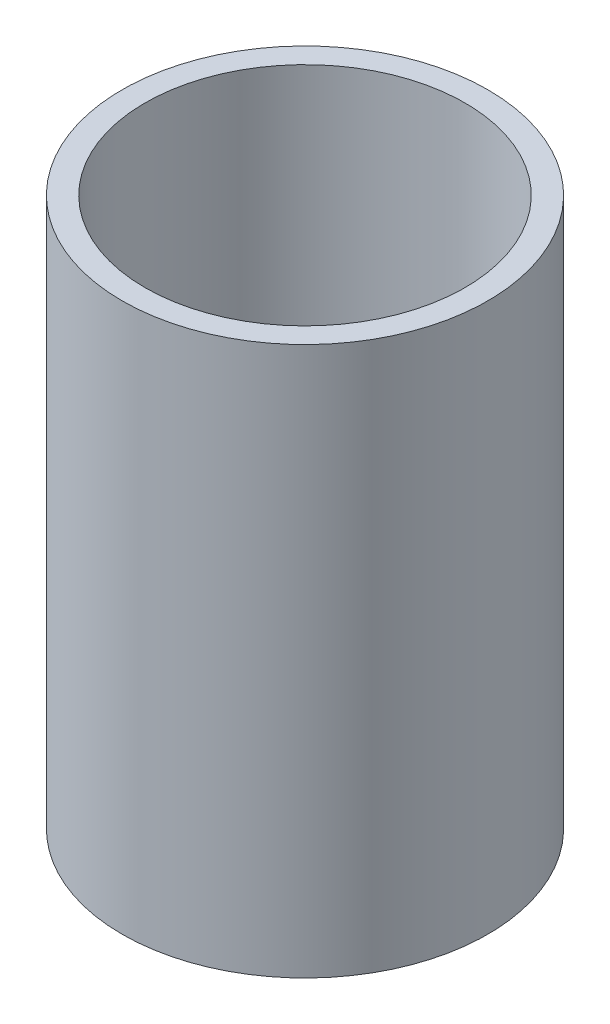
from build123d import *

# Parameters (mm, degrees)
SKETCH1_R      = 12.7
EXTRUDE1_DEPTH = 38.1
SKETCH2_R      = 11.1125
EXTRUDE2_DEPTH = 43.121134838


with BuildPart() as part:
    # Sketch1 → Extrude1 (new body)
    with BuildSketch(Plane(origin=(0, 0, 0), x_dir=(1, 0, 0), z_dir=(0, 1, 0))):
        with Locations(Location((0, 0, 0), (0, 0, 90))):
            Circle(SKETCH1_R)
    extrude(amount=EXTRUDE1_DEPTH)

    # Sketch2 → Extrude2 (cut, through all)
    with BuildSketch(Plane(origin=(0, 38.1, 0), x_dir=(1, 0, 0), z_dir=(0, 1, 0))):
        with Locations(Location((0, 0, 0), (0, 0, 270))):
            Circle(SKETCH2_R)
    extrude(amount=-EXTRUDE2_DEPTH, mode=Mode.SUBTRACT)


solid = part.part
